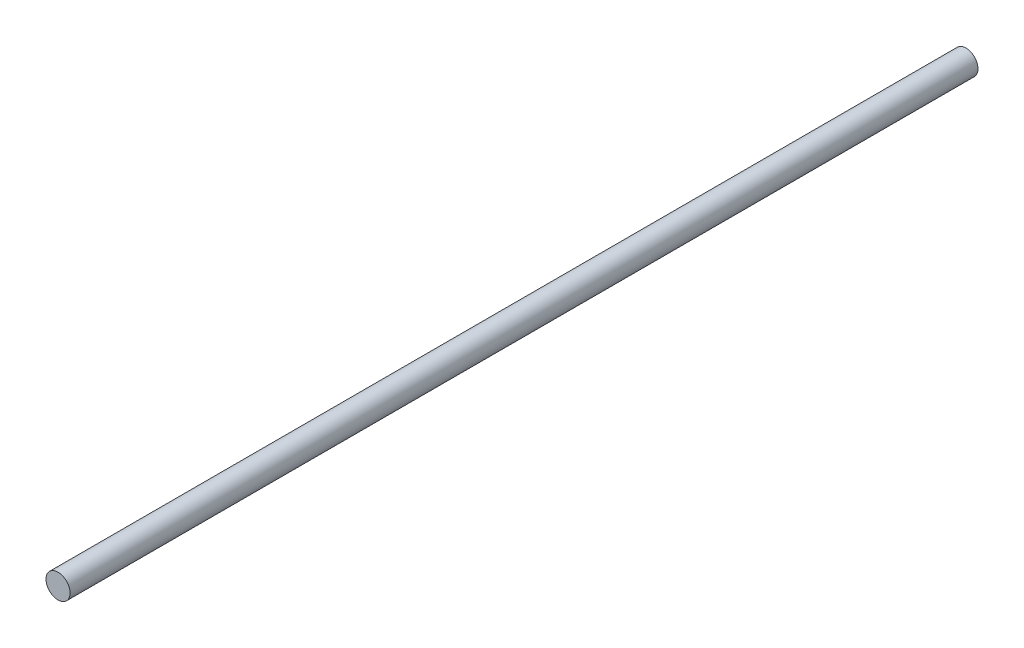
ISO-10303-21;
HEADER;
FILE_DESCRIPTION(('STEP AP214'),'2;1');
FILE_NAME('part.step','',(''),(''),'','','');
FILE_SCHEMA(('AUTOMOTIVE_DESIGN { 1 0 10303 214 1 1 1 1 }'));
ENDSEC;
DATA;
#1=APPLICATION_CONTEXT('core data for automotive mechanical design processes');
#2=APPLICATION_PROTOCOL_DEFINITION('international standard','automotive_design',2000,#1);
#3=PRODUCT_CONTEXT('',#1,'mechanical');
#4=PRODUCT('Part','Part','',(#3));
#5=PRODUCT_RELATED_PRODUCT_CATEGORY('part','',(#4));
#6=PRODUCT_DEFINITION_FORMATION('','',#4);
#7=PRODUCT_DEFINITION_CONTEXT('part definition',#1,'design');
#8=PRODUCT_DEFINITION('design','',#6,#7);
#9=PRODUCT_DEFINITION_SHAPE('','',#8);
#10=(LENGTH_UNIT() NAMED_UNIT(*) SI_UNIT(.MILLI.,.METRE.));
#11=(NAMED_UNIT(*) PLANE_ANGLE_UNIT() SI_UNIT($,.RADIAN.));
#12=(NAMED_UNIT(*) SI_UNIT($,.STERADIAN.) SOLID_ANGLE_UNIT());
#13=UNCERTAINTY_MEASURE_WITH_UNIT(LENGTH_MEASURE(1.E-05),#10,'distance_accuracy_value','');
#14=(GEOMETRIC_REPRESENTATION_CONTEXT(3) GLOBAL_UNCERTAINTY_ASSIGNED_CONTEXT((#13)) GLOBAL_UNIT_ASSIGNED_CONTEXT((#10,
#11,#12)) REPRESENTATION_CONTEXT('',''));
#15=CARTESIAN_POINT('',(0.,0.,0.));
#16=DIRECTION('',(0.,0.,1.));
#17=DIRECTION('',(1.,0.,0.));
#18=AXIS2_PLACEMENT_3D('',#15,#16,#17);
#19=CARTESIAN_POINT('',(0.,0.,188.4));
#20=DIRECTION('',(0.,0.,-1.));
#21=DIRECTION('',(-1.,0.,0.));
#22=AXIS2_PLACEMENT_3D('',#19,#20,#21);
#23=CYLINDRICAL_SURFACE('',#22,2.5);
#24=CARTESIAN_POINT('',(0.,0.,188.4));
#25=DIRECTION('',(0.,0.,1.));
#26=DIRECTION('',(1.,0.,0.));
#27=AXIS2_PLACEMENT_3D('',#24,#25,#26);
#28=CIRCLE('',#27,2.5);
#29=CARTESIAN_POINT('',(2.5,0.,188.4));
#30=VERTEX_POINT('',#29);
#31=EDGE_CURVE('E10',#30,#30,#28,.T.);
#32=ORIENTED_EDGE('',*,*,#31,.F.);
#33=EDGE_LOOP('',(#32));
#34=FACE_BOUND('',#33,.T.);
#35=CARTESIAN_POINT('',(0.,0.,0.));
#36=DIRECTION('',(0.,0.,1.));
#37=DIRECTION('',(1.,0.,0.));
#38=AXIS2_PLACEMENT_3D('',#35,#36,#37);
#39=CIRCLE('',#38,2.5);
#40=CARTESIAN_POINT('',(2.5,0.,0.));
#41=VERTEX_POINT('',#40);
#42=EDGE_CURVE('E34',#41,#41,#39,.T.);
#43=ORIENTED_EDGE('',*,*,#42,.T.);
#44=EDGE_LOOP('',(#43));
#45=FACE_BOUND('',#44,.T.);
#46=ADVANCED_FACE('F31',(#34,#45),#23,.T.);
#47=CARTESIAN_POINT('',(0.,0.,188.4));
#48=DIRECTION('',(0.,0.,1.));
#49=DIRECTION('',(1.,0.,0.));
#50=AXIS2_PLACEMENT_3D('',#47,#48,#49);
#51=PLANE('',#50);
#52=ORIENTED_EDGE('',*,*,#31,.T.);
#53=EDGE_LOOP('',(#52));
#54=FACE_BOUND('',#53,.T.);
#55=ADVANCED_FACE('F46',(#54),#51,.T.);
#56=CARTESIAN_POINT('',(0.,0.,0.));
#57=DIRECTION('',(0.,0.,1.));
#58=DIRECTION('',(1.,0.,0.));
#59=AXIS2_PLACEMENT_3D('',#56,#57,#58);
#60=PLANE('',#59);
#61=ORIENTED_EDGE('',*,*,#42,.F.);
#62=EDGE_LOOP('',(#61));
#63=FACE_BOUND('',#62,.T.);
#64=ADVANCED_FACE('F44',(#63),#60,.F.);
#65=CLOSED_SHELL('',(#46,#55,#64));
#66=MANIFOLD_SOLID_BREP('B2',#65);
#67=ADVANCED_BREP_SHAPE_REPRESENTATION('',(#18,#66),#14);
#68=SHAPE_DEFINITION_REPRESENTATION(#9,#67);
ENDSEC;
END-ISO-10303-21;
